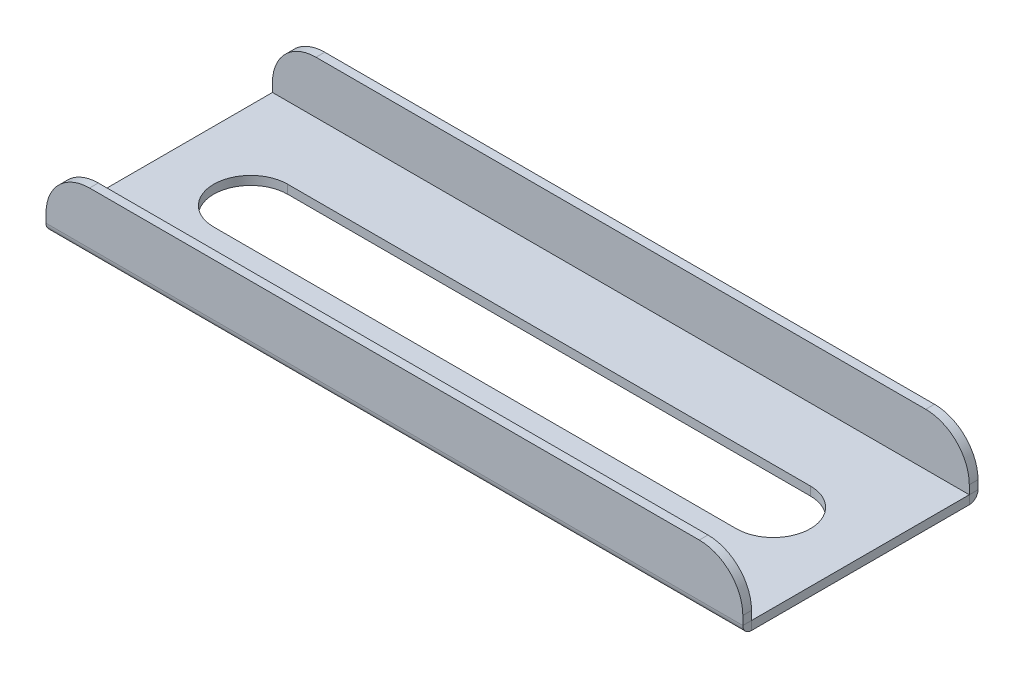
ISO-10303-21;
HEADER;
FILE_DESCRIPTION(('STEP AP214'),'2;1');
FILE_NAME('part.step','',(''),(''),'','','');
FILE_SCHEMA(('AUTOMOTIVE_DESIGN { 1 0 10303 214 1 1 1 1 }'));
ENDSEC;
DATA;
#1=APPLICATION_CONTEXT('core data for automotive mechanical design processes');
#2=APPLICATION_PROTOCOL_DEFINITION('international standard','automotive_design',2000,#1);
#3=PRODUCT_CONTEXT('',#1,'mechanical');
#4=PRODUCT('Part','Part','',(#3));
#5=PRODUCT_RELATED_PRODUCT_CATEGORY('part','',(#4));
#6=PRODUCT_DEFINITION_FORMATION('','',#4);
#7=PRODUCT_DEFINITION_CONTEXT('part definition',#1,'design');
#8=PRODUCT_DEFINITION('design','',#6,#7);
#9=PRODUCT_DEFINITION_SHAPE('','',#8);
#10=(LENGTH_UNIT() NAMED_UNIT(*) SI_UNIT(.MILLI.,.METRE.));
#11=(NAMED_UNIT(*) PLANE_ANGLE_UNIT() SI_UNIT($,.RADIAN.));
#12=(NAMED_UNIT(*) SI_UNIT($,.STERADIAN.) SOLID_ANGLE_UNIT());
#13=UNCERTAINTY_MEASURE_WITH_UNIT(LENGTH_MEASURE(1.E-05),#10,'distance_accuracy_value','');
#14=(GEOMETRIC_REPRESENTATION_CONTEXT(3) GLOBAL_UNCERTAINTY_ASSIGNED_CONTEXT((#13)) GLOBAL_UNIT_ASSIGNED_CONTEXT((#10,
#11,#12)) REPRESENTATION_CONTEXT('',''));
#15=CARTESIAN_POINT('',(0.,0.,0.));
#16=DIRECTION('',(0.,0.,1.));
#17=DIRECTION('',(1.,0.,0.));
#18=AXIS2_PLACEMENT_3D('',#15,#16,#17);
#19=CARTESIAN_POINT('',(80.,1.,-5.00000000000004));
#20=DIRECTION('',(-1.,0.,0.));
#21=DIRECTION('',(0.,0.,1.));
#22=AXIS2_PLACEMENT_3D('',#19,#20,#21);
#23=PLANE('',#22);
#24=DIRECTION('',(0.,0.,-1.));
#25=VECTOR('',#24,1.);
#26=CARTESIAN_POINT('',(80.,1.,-5.00000000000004));
#27=LINE('',#26,#25);
#28=CARTESIAN_POINT('',(80.,1.,-6.0001));
#29=VERTEX_POINT('',#28);
#30=CARTESIAN_POINT('',(80.,1.,-30.9999));
#31=VERTEX_POINT('',#30);
#32=EDGE_CURVE('E43',#29,#31,#27,.T.);
#33=ORIENTED_EDGE('',*,*,#32,.F.);
#34=DIRECTION('',(0.,-1.,0.));
#35=VECTOR('',#34,1.);
#36=CARTESIAN_POINT('',(80.,1.,-6.0001));
#37=LINE('',#36,#35);
#38=CARTESIAN_POINT('',(80.,0.,-6.0001));
#39=VERTEX_POINT('',#38);
#40=EDGE_CURVE('E12',#29,#39,#37,.T.);
#41=ORIENTED_EDGE('',*,*,#40,.T.);
#42=DIRECTION('',(0.,0.,-1.));
#43=VECTOR('',#42,1.);
#44=CARTESIAN_POINT('',(80.,0.,-5.00000000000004));
#45=LINE('',#44,#43);
#46=CARTESIAN_POINT('',(80.,0.,-30.9999));
#47=VERTEX_POINT('',#46);
#48=EDGE_CURVE('E342',#39,#47,#45,.T.);
#49=ORIENTED_EDGE('',*,*,#48,.T.);
#50=DIRECTION('',(0.,-1.,0.));
#51=VECTOR('',#50,1.);
#52=CARTESIAN_POINT('',(80.,0.999999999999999,-30.9999));
#53=LINE('',#52,#51);
#54=EDGE_CURVE('E327',#31,#47,#53,.T.);
#55=ORIENTED_EDGE('',*,*,#54,.F.);
#56=EDGE_LOOP('',(#33,#41,#49,#55));
#57=FACE_BOUND('',#56,.T.);
#58=ADVANCED_FACE('F40',(#57),#23,.F.);
#59=CARTESIAN_POINT('',(0.,1.,-5.00000000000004));
#60=DIRECTION('',(1.,0.,0.));
#61=DIRECTION('',(0.,0.,-1.));
#62=AXIS2_PLACEMENT_3D('',#59,#60,#61);
#63=PLANE('',#62);
#64=DIRECTION('',(0.,0.,1.));
#65=VECTOR('',#64,1.);
#66=CARTESIAN_POINT('',(0.,0.,-5.00000000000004));
#67=LINE('',#66,#65);
#68=CARTESIAN_POINT('',(0.,0.,-30.9999));
#69=VERTEX_POINT('',#68);
#70=CARTESIAN_POINT('',(0.,0.,-6.00010000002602));
#71=VERTEX_POINT('',#70);
#72=EDGE_CURVE('E64',#69,#71,#67,.T.);
#73=ORIENTED_EDGE('',*,*,#72,.T.);
#74=DIRECTION('',(0.,1.,0.));
#75=VECTOR('',#74,1.);
#76=CARTESIAN_POINT('',(0.,1.,-6.0001));
#77=LINE('',#76,#75);
#78=CARTESIAN_POINT('',(0.,1.,-6.0001));
#79=VERTEX_POINT('',#78);
#80=EDGE_CURVE('E338',#71,#79,#77,.T.);
#81=ORIENTED_EDGE('',*,*,#80,.T.);
#82=DIRECTION('',(0.,0.,1.));
#83=VECTOR('',#82,1.);
#84=CARTESIAN_POINT('',(0.,1.,-5.00000000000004));
#85=LINE('',#84,#83);
#86=CARTESIAN_POINT('',(0.,1.,-30.9999));
#87=VERTEX_POINT('',#86);
#88=EDGE_CURVE('E344',#87,#79,#85,.T.);
#89=ORIENTED_EDGE('',*,*,#88,.F.);
#90=DIRECTION('',(0.,1.,0.));
#91=VECTOR('',#90,1.);
#92=CARTESIAN_POINT('',(0.,0.999999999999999,-30.9999));
#93=LINE('',#92,#91);
#94=EDGE_CURVE('E333',#69,#87,#93,.T.);
#95=ORIENTED_EDGE('',*,*,#94,.F.);
#96=EDGE_LOOP('',(#73,#81,#89,#95));
#97=FACE_BOUND('',#96,.T.);
#98=ADVANCED_FACE('F368',(#97),#63,.F.);
#99=CARTESIAN_POINT('',(75.,0.,-32.));
#100=DIRECTION('',(0.,1.,0.));
#101=DIRECTION('',(0.,0.,1.));
#102=AXIS2_PLACEMENT_3D('',#99,#100,#101);
#103=PLANE('',#102);
#104=CARTESIAN_POINT('',(70.,0.,-18.5));
#105=DIRECTION('',(0.,1.,0.));
#106=DIRECTION('',(0.,0.,1.));
#107=AXIS2_PLACEMENT_3D('',#104,#105,#106);
#108=CIRCLE('',#107,4.25000000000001);
#109=CARTESIAN_POINT('',(70.,0.,-14.25));
#110=VERTEX_POINT('',#109);
#111=CARTESIAN_POINT('',(70.,0.,-22.75));
#112=VERTEX_POINT('',#111);
#113=EDGE_CURVE('E289',#110,#112,#108,.T.);
#114=ORIENTED_EDGE('',*,*,#113,.T.);
#115=DIRECTION('',(-1.,0.,0.));
#116=VECTOR('',#115,1.);
#117=CARTESIAN_POINT('',(70.,0.,-22.75));
#118=LINE('',#117,#116);
#119=CARTESIAN_POINT('',(10.,0.,-22.75));
#120=VERTEX_POINT('',#119);
#121=EDGE_CURVE('E307',#112,#120,#118,.T.);
#122=ORIENTED_EDGE('',*,*,#121,.T.);
#123=CARTESIAN_POINT('',(10.,0.,-18.5));
#124=DIRECTION('',(0.,1.,0.));
#125=DIRECTION('',(0.,0.,1.));
#126=AXIS2_PLACEMENT_3D('',#123,#124,#125);
#127=CIRCLE('',#126,4.25000000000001);
#128=CARTESIAN_POINT('',(10.,0.,-14.25));
#129=VERTEX_POINT('',#128);
#130=EDGE_CURVE('E310',#120,#129,#127,.T.);
#131=ORIENTED_EDGE('',*,*,#130,.T.);
#132=DIRECTION('',(1.,0.,0.));
#133=VECTOR('',#132,1.);
#134=CARTESIAN_POINT('',(10.,0.,-14.25));
#135=LINE('',#134,#133);
#136=EDGE_CURVE('E297',#129,#110,#135,.T.);
#137=ORIENTED_EDGE('',*,*,#136,.T.);
#138=EDGE_LOOP('',(#114,#122,#131,#137));
#139=FACE_BOUND('',#138,.T.);
#140=ORIENTED_EDGE('',*,*,#48,.F.);
#141=DIRECTION('',(-1.,0.,0.));
#142=VECTOR('',#141,1.);
#143=CARTESIAN_POINT('',(75.,0.,-6.0001));
#144=LINE('',#143,#142);
#145=EDGE_CURVE('E48',#39,#71,#144,.T.);
#146=ORIENTED_EDGE('',*,*,#145,.T.);
#147=ORIENTED_EDGE('',*,*,#72,.F.);
#148=DIRECTION('',(-1.,0.,0.));
#149=VECTOR('',#148,1.);
#150=CARTESIAN_POINT('',(75.,0.,-30.9999));
#151=LINE('',#150,#149);
#152=EDGE_CURVE('E330',#47,#69,#151,.T.);
#153=ORIENTED_EDGE('',*,*,#152,.F.);
#154=EDGE_LOOP('',(#140,#146,#147,#153));
#155=FACE_BOUND('',#154,.T.);
#156=ADVANCED_FACE('F418',(#139,#155),#103,.F.);
#157=CARTESIAN_POINT('',(75.,1.,-32.));
#158=DIRECTION('',(0.,1.,0.));
#159=DIRECTION('',(0.,0.,1.));
#160=AXIS2_PLACEMENT_3D('',#157,#158,#159);
#161=PLANE('',#160);
#162=DIRECTION('',(-1.,0.,0.));
#163=VECTOR('',#162,1.);
#164=CARTESIAN_POINT('',(75.,1.,-6.0001));
#165=LINE('',#164,#163);
#166=EDGE_CURVE('E336',#29,#79,#165,.T.);
#167=ORIENTED_EDGE('',*,*,#166,.F.);
#168=ORIENTED_EDGE('',*,*,#32,.T.);
#169=DIRECTION('',(-1.,0.,0.));
#170=VECTOR('',#169,1.);
#171=CARTESIAN_POINT('',(75.,1.,-30.9999));
#172=LINE('',#171,#170);
#173=EDGE_CURVE('E324',#31,#87,#172,.T.);
#174=ORIENTED_EDGE('',*,*,#173,.T.);
#175=ORIENTED_EDGE('',*,*,#88,.T.);
#176=EDGE_LOOP('',(#167,#168,#174,#175));
#177=FACE_BOUND('',#176,.T.);
#178=DIRECTION('',(-1.,0.,0.));
#179=VECTOR('',#178,1.);
#180=CARTESIAN_POINT('',(70.,1.,-22.75));
#181=LINE('',#180,#179);
#182=CARTESIAN_POINT('',(70.,1.,-22.75));
#183=VERTEX_POINT('',#182);
#184=CARTESIAN_POINT('',(10.,1.,-22.75));
#185=VERTEX_POINT('',#184);
#186=EDGE_CURVE('E296',#183,#185,#181,.T.);
#187=ORIENTED_EDGE('',*,*,#186,.F.);
#188=CARTESIAN_POINT('',(70.,1.,-18.5));
#189=DIRECTION('',(0.,1.,0.));
#190=DIRECTION('',(0.,0.,1.));
#191=AXIS2_PLACEMENT_3D('',#188,#189,#190);
#192=CIRCLE('',#191,4.25000000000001);
#193=CARTESIAN_POINT('',(70.,1.,-14.25));
#194=VERTEX_POINT('',#193);
#195=EDGE_CURVE('E294',#194,#183,#192,.T.);
#196=ORIENTED_EDGE('',*,*,#195,.F.);
#197=DIRECTION('',(1.,0.,0.));
#198=VECTOR('',#197,1.);
#199=CARTESIAN_POINT('',(10.,1.,-14.25));
#200=LINE('',#199,#198);
#201=CARTESIAN_POINT('',(9.99999999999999,1.,-14.25));
#202=VERTEX_POINT('',#201);
#203=EDGE_CURVE('E302',#202,#194,#200,.T.);
#204=ORIENTED_EDGE('',*,*,#203,.F.);
#205=CARTESIAN_POINT('',(10.,1.,-18.5));
#206=DIRECTION('',(0.,1.,0.));
#207=DIRECTION('',(0.,0.,1.));
#208=AXIS2_PLACEMENT_3D('',#205,#206,#207);
#209=CIRCLE('',#208,4.25000000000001);
#210=EDGE_CURVE('E299',#185,#202,#209,.T.);
#211=ORIENTED_EDGE('',*,*,#210,.F.);
#212=EDGE_LOOP('',(#187,#196,#204,#211));
#213=FACE_BOUND('',#212,.T.);
#214=ADVANCED_FACE('F350',(#177,#213),#161,.T.);
#215=CARTESIAN_POINT('',(70.,1.,-18.5));
#216=DIRECTION('',(0.,-1.,0.));
#217=DIRECTION('',(0.,0.,-1.));
#218=AXIS2_PLACEMENT_3D('',#215,#216,#217);
#219=CYLINDRICAL_SURFACE('',#218,4.25000000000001);
#220=ORIENTED_EDGE('',*,*,#113,.F.);
#221=DIRECTION('',(0.,-1.,0.));
#222=VECTOR('',#221,1.);
#223=CARTESIAN_POINT('',(70.,1.,-14.25));
#224=LINE('',#223,#222);
#225=EDGE_CURVE('E304',#194,#110,#224,.T.);
#226=ORIENTED_EDGE('',*,*,#225,.F.);
#227=ORIENTED_EDGE('',*,*,#195,.T.);
#228=DIRECTION('',(0.,-1.,0.));
#229=VECTOR('',#228,1.);
#230=CARTESIAN_POINT('',(70.,1.,-22.75));
#231=LINE('',#230,#229);
#232=EDGE_CURVE('E321',#183,#112,#231,.T.);
#233=ORIENTED_EDGE('',*,*,#232,.T.);
#234=EDGE_LOOP('',(#220,#226,#227,#233));
#235=FACE_BOUND('',#234,.T.);
#236=ADVANCED_FACE('F427',(#235),#219,.F.);
#237=CARTESIAN_POINT('',(70.,1.,-22.75));
#238=DIRECTION('',(0.,0.,1.));
#239=DIRECTION('',(1.,0.,0.));
#240=AXIS2_PLACEMENT_3D('',#237,#238,#239);
#241=PLANE('',#240);
#242=ORIENTED_EDGE('',*,*,#121,.F.);
#243=ORIENTED_EDGE('',*,*,#232,.F.);
#244=ORIENTED_EDGE('',*,*,#186,.T.);
#245=DIRECTION('',(0.,-1.,0.));
#246=VECTOR('',#245,1.);
#247=CARTESIAN_POINT('',(10.,1.,-22.75));
#248=LINE('',#247,#246);
#249=EDGE_CURVE('E319',#185,#120,#248,.T.);
#250=ORIENTED_EDGE('',*,*,#249,.T.);
#251=EDGE_LOOP('',(#242,#243,#244,#250));
#252=FACE_BOUND('',#251,.T.);
#253=ADVANCED_FACE('F430',(#252),#241,.T.);
#254=CARTESIAN_POINT('',(10.,1.,-18.5));
#255=DIRECTION('',(0.,-1.,0.));
#256=DIRECTION('',(0.,0.,-1.));
#257=AXIS2_PLACEMENT_3D('',#254,#255,#256);
#258=CYLINDRICAL_SURFACE('',#257,4.25000000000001);
#259=ORIENTED_EDGE('',*,*,#130,.F.);
#260=ORIENTED_EDGE('',*,*,#249,.F.);
#261=ORIENTED_EDGE('',*,*,#210,.T.);
#262=DIRECTION('',(0.,-1.,0.));
#263=VECTOR('',#262,1.);
#264=CARTESIAN_POINT('',(10.,1.,-14.25));
#265=LINE('',#264,#263);
#266=EDGE_CURVE('E317',#202,#129,#265,.T.);
#267=ORIENTED_EDGE('',*,*,#266,.T.);
#268=EDGE_LOOP('',(#259,#260,#261,#267));
#269=FACE_BOUND('',#268,.T.);
#270=ADVANCED_FACE('F434',(#269),#258,.F.);
#271=CARTESIAN_POINT('',(10.,1.,-14.25));
#272=DIRECTION('',(0.,0.,-1.));
#273=DIRECTION('',(-1.,0.,0.));
#274=AXIS2_PLACEMENT_3D('',#271,#272,#273);
#275=PLANE('',#274);
#276=ORIENTED_EDGE('',*,*,#136,.F.);
#277=ORIENTED_EDGE('',*,*,#266,.F.);
#278=ORIENTED_EDGE('',*,*,#203,.T.);
#279=ORIENTED_EDGE('',*,*,#225,.T.);
#280=EDGE_LOOP('',(#276,#277,#278,#279));
#281=FACE_BOUND('',#280,.T.);
#282=ADVANCED_FACE('F438',(#281),#275,.T.);
#283=CARTESIAN_POINT('',(80.,1.0001,-30.9999));
#284=DIRECTION('',(-1.,0.,0.));
#285=DIRECTION('',(0.,0.,1.));
#286=AXIS2_PLACEMENT_3D('',#283,#284,#285);
#287=PLANE('',#286);
#288=ORIENTED_EDGE('',*,*,#54,.T.);
#289=CARTESIAN_POINT('',(80.,1.0001,-30.9999));
#290=DIRECTION('',(-1.,0.,0.));
#291=DIRECTION('',(0.,0.,1.));
#292=AXIS2_PLACEMENT_3D('',#289,#290,#291);
#293=CIRCLE('',#292,1.0001);
#294=CARTESIAN_POINT('',(80.,1.0001,-32.));
#295=VERTEX_POINT('',#294);
#296=EDGE_CURVE('E239',#47,#295,#293,.F.);
#297=ORIENTED_EDGE('',*,*,#296,.T.);
#298=DIRECTION('',(0.,0.,-1.));
#299=VECTOR('',#298,1.);
#300=CARTESIAN_POINT('',(80.,1.0001,-31.));
#301=LINE('',#300,#299);
#302=CARTESIAN_POINT('',(80.,1.0001,-31.));
#303=VERTEX_POINT('',#302);
#304=EDGE_CURVE('E249',#303,#295,#301,.T.);
#305=ORIENTED_EDGE('',*,*,#304,.F.);
#306=CARTESIAN_POINT('',(80.,1.0001,-30.9999));
#307=DIRECTION('',(1.,0.,0.));
#308=DIRECTION('',(0.,0.,-1.));
#309=AXIS2_PLACEMENT_3D('',#306,#307,#308);
#310=CIRCLE('',#309,9.99999999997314E-05);
#311=EDGE_CURVE('E282',#31,#303,#310,.T.);
#312=ORIENTED_EDGE('',*,*,#311,.F.);
#313=EDGE_LOOP('',(#288,#297,#305,#312));
#314=FACE_BOUND('',#313,.T.);
#315=ADVANCED_FACE('F359',(#314),#287,.F.);
#316=CARTESIAN_POINT('',(0.,1.0001,-30.9999));
#317=DIRECTION('',(1.,0.,0.));
#318=DIRECTION('',(0.,0.,-1.));
#319=AXIS2_PLACEMENT_3D('',#316,#317,#318);
#320=PLANE('',#319);
#321=DIRECTION('',(0.,0.,1.));
#322=VECTOR('',#321,1.);
#323=CARTESIAN_POINT('',(0.,1.0001,-31.));
#324=LINE('',#323,#322);
#325=CARTESIAN_POINT('',(0.,1.0001,-32.));
#326=VERTEX_POINT('',#325);
#327=CARTESIAN_POINT('',(0.,1.0001,-31.));
#328=VERTEX_POINT('',#327);
#329=EDGE_CURVE('E240',#326,#328,#324,.T.);
#330=ORIENTED_EDGE('',*,*,#329,.F.);
#331=CARTESIAN_POINT('',(0.,1.0001,-30.9999));
#332=DIRECTION('',(-1.,0.,0.));
#333=DIRECTION('',(0.,0.,1.));
#334=AXIS2_PLACEMENT_3D('',#331,#332,#333);
#335=CIRCLE('',#334,1.0001);
#336=EDGE_CURVE('E286',#326,#69,#335,.T.);
#337=ORIENTED_EDGE('',*,*,#336,.T.);
#338=ORIENTED_EDGE('',*,*,#94,.T.);
#339=CARTESIAN_POINT('',(0.,1.0001,-30.9999));
#340=DIRECTION('',(-1.,0.,0.));
#341=DIRECTION('',(0.,0.,1.));
#342=AXIS2_PLACEMENT_3D('',#339,#340,#341);
#343=CIRCLE('',#342,9.99999999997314E-05);
#344=EDGE_CURVE('E285',#328,#87,#343,.T.);
#345=ORIENTED_EDGE('',*,*,#344,.F.);
#346=EDGE_LOOP('',(#330,#337,#338,#345));
#347=FACE_BOUND('',#346,.T.);
#348=ADVANCED_FACE('F365',(#347),#320,.F.);
#349=CARTESIAN_POINT('',(120.006249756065,1.0001,-30.9999));
#350=DIRECTION('',(-1.,0.,0.));
#351=DIRECTION('',(0.,0.,1.));
#352=AXIS2_PLACEMENT_3D('',#349,#350,#351);
#353=CYLINDRICAL_SURFACE('',#352,0.0001);
#354=ORIENTED_EDGE('',*,*,#344,.T.);
#355=ORIENTED_EDGE('',*,*,#173,.F.);
#356=ORIENTED_EDGE('',*,*,#311,.T.);
#357=DIRECTION('',(-1.,0.,0.));
#358=VECTOR('',#357,1.);
#359=CARTESIAN_POINT('',(75.,1.0001,-31.));
#360=LINE('',#359,#358);
#361=EDGE_CURVE('E231',#303,#328,#360,.T.);
#362=ORIENTED_EDGE('',*,*,#361,.T.);
#363=EDGE_LOOP('',(#354,#355,#356,#362));
#364=FACE_BOUND('',#363,.T.);
#365=ADVANCED_FACE('F361',(#364),#353,.F.);
#366=CARTESIAN_POINT('',(120.006249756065,1.0001,-30.9999));
#367=DIRECTION('',(-1.,0.,0.));
#368=DIRECTION('',(0.,0.,1.));
#369=AXIS2_PLACEMENT_3D('',#366,#367,#368);
#370=CYLINDRICAL_SURFACE('',#369,1.0001);
#371=ORIENTED_EDGE('',*,*,#336,.F.);
#372=DIRECTION('',(-1.,0.,0.));
#373=VECTOR('',#372,1.);
#374=CARTESIAN_POINT('',(75.,1.0001,-32.));
#375=LINE('',#374,#373);
#376=EDGE_CURVE('E244',#295,#326,#375,.T.);
#377=ORIENTED_EDGE('',*,*,#376,.F.);
#378=ORIENTED_EDGE('',*,*,#296,.F.);
#379=ORIENTED_EDGE('',*,*,#152,.T.);
#380=EDGE_LOOP('',(#371,#377,#378,#379));
#381=FACE_BOUND('',#380,.T.);
#382=ADVANCED_FACE('F447',(#381),#370,.T.);
#383=CARTESIAN_POINT('',(5.,2.00002721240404,-31.));
#384=DIRECTION('',(0.,0.,-1.));
#385=DIRECTION('',(0.,1.,0.));
#386=AXIS2_PLACEMENT_3D('',#383,#384,#385);
#387=CYLINDRICAL_SURFACE('',#386,5.);
#388=CARTESIAN_POINT('',(5.,2.00002721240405,-32.));
#389=DIRECTION('',(0.,0.,1.));
#390=DIRECTION('',(0.,1.,0.));
#391=AXIS2_PLACEMENT_3D('',#388,#389,#390);
#392=CIRCLE('',#391,5.);
#393=CARTESIAN_POINT('',(5.,7.00002721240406,-32.));
#394=VERTEX_POINT('',#393);
#395=CARTESIAN_POINT('',(0.,2.00002721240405,-32.));
#396=VERTEX_POINT('',#395);
#397=EDGE_CURVE('E278',#394,#396,#392,.T.);
#398=ORIENTED_EDGE('',*,*,#397,.T.);
#399=DIRECTION('',(0.,0.,-1.));
#400=VECTOR('',#399,1.);
#401=CARTESIAN_POINT('',(0.,2.00002721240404,-31.));
#402=LINE('',#401,#400);
#403=CARTESIAN_POINT('',(0.,2.00002721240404,-31.));
#404=VERTEX_POINT('',#403);
#405=EDGE_CURVE('E236',#404,#396,#402,.T.);
#406=ORIENTED_EDGE('',*,*,#405,.F.);
#407=CARTESIAN_POINT('',(5.,2.00002721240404,-31.));
#408=DIRECTION('',(0.,0.,1.));
#409=DIRECTION('',(0.,1.,0.));
#410=AXIS2_PLACEMENT_3D('',#407,#408,#409);
#411=CIRCLE('',#410,5.);
#412=CARTESIAN_POINT('',(5.,7.00002721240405,-31.));
#413=VERTEX_POINT('',#412);
#414=EDGE_CURVE('E255',#413,#404,#411,.T.);
#415=ORIENTED_EDGE('',*,*,#414,.F.);
#416=DIRECTION('',(0.,0.,-1.));
#417=VECTOR('',#416,1.);
#418=CARTESIAN_POINT('',(5.,7.00002721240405,-31.));
#419=LINE('',#418,#417);
#420=EDGE_CURVE('E275',#413,#394,#419,.T.);
#421=ORIENTED_EDGE('',*,*,#420,.T.);
#422=EDGE_LOOP('',(#398,#406,#415,#421));
#423=FACE_BOUND('',#422,.T.);
#424=ADVANCED_FACE('F450',(#423),#387,.T.);
#425=CARTESIAN_POINT('',(5.,7.00002721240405,-31.));
#426=DIRECTION('',(0.,-1.,0.));
#427=DIRECTION('',(1.,0.,0.));
#428=AXIS2_PLACEMENT_3D('',#425,#426,#427);
#429=PLANE('',#428);
#430=DIRECTION('',(-1.,0.,0.));
#431=VECTOR('',#430,1.);
#432=CARTESIAN_POINT('',(5.,7.00002721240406,-32.));
#433=LINE('',#432,#431);
#434=CARTESIAN_POINT('',(75.,7.00002721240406,-32.));
#435=VERTEX_POINT('',#434);
#436=EDGE_CURVE('E273',#435,#394,#433,.T.);
#437=ORIENTED_EDGE('',*,*,#436,.T.);
#438=ORIENTED_EDGE('',*,*,#420,.F.);
#439=DIRECTION('',(-1.,0.,0.));
#440=VECTOR('',#439,1.);
#441=CARTESIAN_POINT('',(5.,7.00002721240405,-31.));
#442=LINE('',#441,#440);
#443=CARTESIAN_POINT('',(75.,7.00002721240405,-31.));
#444=VERTEX_POINT('',#443);
#445=EDGE_CURVE('E257',#444,#413,#442,.T.);
#446=ORIENTED_EDGE('',*,*,#445,.F.);
#447=DIRECTION('',(0.,0.,-1.));
#448=VECTOR('',#447,1.);
#449=CARTESIAN_POINT('',(75.,7.00002721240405,-31.));
#450=LINE('',#449,#448);
#451=EDGE_CURVE('E270',#444,#435,#450,.T.);
#452=ORIENTED_EDGE('',*,*,#451,.T.);
#453=EDGE_LOOP('',(#437,#438,#446,#452));
#454=FACE_BOUND('',#453,.T.);
#455=ADVANCED_FACE('F473',(#454),#429,.F.);
#456=CARTESIAN_POINT('',(75.,2.00002721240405,-31.));
#457=DIRECTION('',(0.,0.,-1.));
#458=DIRECTION('',(0.,1.,0.));
#459=AXIS2_PLACEMENT_3D('',#456,#457,#458);
#460=CYLINDRICAL_SURFACE('',#459,5.);
#461=CARTESIAN_POINT('',(75.,2.00002721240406,-32.));
#462=DIRECTION('',(0.,0.,1.));
#463=DIRECTION('',(0.,-1.,0.));
#464=AXIS2_PLACEMENT_3D('',#461,#462,#463);
#465=CIRCLE('',#464,5.);
#466=CARTESIAN_POINT('',(80.,2.00002721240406,-32.));
#467=VERTEX_POINT('',#466);
#468=EDGE_CURVE('E267',#467,#435,#465,.T.);
#469=ORIENTED_EDGE('',*,*,#468,.T.);
#470=ORIENTED_EDGE('',*,*,#451,.F.);
#471=CARTESIAN_POINT('',(75.,2.00002721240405,-31.));
#472=DIRECTION('',(0.,0.,1.));
#473=DIRECTION('',(0.,-1.,0.));
#474=AXIS2_PLACEMENT_3D('',#471,#472,#473);
#475=CIRCLE('',#474,5.);
#476=CARTESIAN_POINT('',(80.,2.00002721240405,-31.));
#477=VERTEX_POINT('',#476);
#478=EDGE_CURVE('E259',#477,#444,#475,.T.);
#479=ORIENTED_EDGE('',*,*,#478,.F.);
#480=DIRECTION('',(0.,0.,-1.));
#481=VECTOR('',#480,1.);
#482=CARTESIAN_POINT('',(80.,2.00002721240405,-31.));
#483=LINE('',#482,#481);
#484=EDGE_CURVE('E264',#477,#467,#483,.T.);
#485=ORIENTED_EDGE('',*,*,#484,.T.);
#486=EDGE_LOOP('',(#469,#470,#479,#485));
#487=FACE_BOUND('',#486,.T.);
#488=ADVANCED_FACE('F469',(#487),#460,.T.);
#489=CARTESIAN_POINT('',(75.,2.00002721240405,-31.));
#490=DIRECTION('',(0.,0.,1.));
#491=DIRECTION('',(0.,-1.,0.));
#492=AXIS2_PLACEMENT_3D('',#489,#490,#491);
#493=PLANE('',#492);
#494=ORIENTED_EDGE('',*,*,#361,.F.);
#495=DIRECTION('',(0.,1.,0.));
#496=VECTOR('',#495,1.);
#497=CARTESIAN_POINT('',(80.,-24.9999727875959,-31.0000000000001));
#498=LINE('',#497,#496);
#499=EDGE_CURVE('E262',#303,#477,#498,.T.);
#500=ORIENTED_EDGE('',*,*,#499,.T.);
#501=ORIENTED_EDGE('',*,*,#478,.T.);
#502=ORIENTED_EDGE('',*,*,#445,.T.);
#503=ORIENTED_EDGE('',*,*,#414,.T.);
#504=DIRECTION('',(0.,-1.,0.));
#505=VECTOR('',#504,1.);
#506=CARTESIAN_POINT('',(0.,-24.9999727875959,-31.0000000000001));
#507=LINE('',#506,#505);
#508=EDGE_CURVE('E252',#404,#328,#507,.T.);
#509=ORIENTED_EDGE('',*,*,#508,.T.);
#510=EDGE_LOOP('',(#494,#500,#501,#502,#503,#509));
#511=FACE_BOUND('',#510,.T.);
#512=ADVANCED_FACE('F465',(#511),#493,.T.);
#513=CARTESIAN_POINT('',(80.,-24.9999727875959,-31.0000000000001));
#514=DIRECTION('',(-1.,0.,0.));
#515=DIRECTION('',(0.,-1.,0.));
#516=AXIS2_PLACEMENT_3D('',#513,#514,#515);
#517=PLANE('',#516);
#518=ORIENTED_EDGE('',*,*,#499,.F.);
#519=ORIENTED_EDGE('',*,*,#304,.T.);
#520=DIRECTION('',(0.,1.,0.));
#521=VECTOR('',#520,1.);
#522=CARTESIAN_POINT('',(80.,-24.9999727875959,-32.0000000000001));
#523=LINE('',#522,#521);
#524=EDGE_CURVE('E247',#295,#467,#523,.T.);
#525=ORIENTED_EDGE('',*,*,#524,.T.);
#526=ORIENTED_EDGE('',*,*,#484,.F.);
#527=EDGE_LOOP('',(#518,#519,#525,#526));
#528=FACE_BOUND('',#527,.T.);
#529=ADVANCED_FACE('F461',(#528),#517,.F.);
#530=CARTESIAN_POINT('',(75.,2.00002721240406,-32.));
#531=DIRECTION('',(0.,0.,1.));
#532=DIRECTION('',(0.,-1.,0.));
#533=AXIS2_PLACEMENT_3D('',#530,#531,#532);
#534=PLANE('',#533);
#535=ORIENTED_EDGE('',*,*,#524,.F.);
#536=ORIENTED_EDGE('',*,*,#376,.T.);
#537=DIRECTION('',(0.,-1.,0.));
#538=VECTOR('',#537,1.);
#539=CARTESIAN_POINT('',(0.,-24.9999727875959,-32.0000000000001));
#540=LINE('',#539,#538);
#541=EDGE_CURVE('E242',#396,#326,#540,.T.);
#542=ORIENTED_EDGE('',*,*,#541,.F.);
#543=ORIENTED_EDGE('',*,*,#397,.F.);
#544=ORIENTED_EDGE('',*,*,#436,.F.);
#545=ORIENTED_EDGE('',*,*,#468,.F.);
#546=EDGE_LOOP('',(#535,#536,#542,#543,#544,#545));
#547=FACE_BOUND('',#546,.T.);
#548=ADVANCED_FACE('F457',(#547),#534,.F.);
#549=CARTESIAN_POINT('',(0.,-24.9999727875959,-31.0000000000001));
#550=DIRECTION('',(1.,0.,0.));
#551=DIRECTION('',(0.,1.,0.));
#552=AXIS2_PLACEMENT_3D('',#549,#550,#551);
#553=PLANE('',#552);
#554=ORIENTED_EDGE('',*,*,#541,.T.);
#555=ORIENTED_EDGE('',*,*,#329,.T.);
#556=ORIENTED_EDGE('',*,*,#508,.F.);
#557=ORIENTED_EDGE('',*,*,#405,.T.);
#558=EDGE_LOOP('',(#554,#555,#556,#557));
#559=FACE_BOUND('',#558,.T.);
#560=ADVANCED_FACE('F454',(#559),#553,.F.);
#561=CARTESIAN_POINT('',(80.,1.0001,-6.0001));
#562=DIRECTION('',(-1.,0.,0.));
#563=DIRECTION('',(0.,0.,1.));
#564=AXIS2_PLACEMENT_3D('',#561,#562,#563);
#565=PLANE('',#564);
#566=DIRECTION('',(0.,0.,1.));
#567=VECTOR('',#566,1.);
#568=CARTESIAN_POINT('',(80.,1.0001,-6.));
#569=LINE('',#568,#567);
#570=CARTESIAN_POINT('',(80.,1.0001,-6.));
#571=VERTEX_POINT('',#570);
#572=CARTESIAN_POINT('',(80.,1.0001,-5.));
#573=VERTEX_POINT('',#572);
#574=EDGE_CURVE('E222',#571,#573,#569,.T.);
#575=ORIENTED_EDGE('',*,*,#574,.T.);
#576=CARTESIAN_POINT('',(80.,1.0001,-6.0001));
#577=DIRECTION('',(1.,0.,0.));
#578=DIRECTION('',(0.,0.,-1.));
#579=AXIS2_PLACEMENT_3D('',#576,#577,#578);
#580=CIRCLE('',#579,1.0001);
#581=EDGE_CURVE('E56',#573,#39,#580,.T.);
#582=ORIENTED_EDGE('',*,*,#581,.T.);
#583=ORIENTED_EDGE('',*,*,#40,.F.);
#584=CARTESIAN_POINT('',(80.,1.0001,-6.0001));
#585=DIRECTION('',(1.,0.,0.));
#586=DIRECTION('',(0.,0.,-1.));
#587=AXIS2_PLACEMENT_3D('',#584,#585,#586);
#588=CIRCLE('',#587,0.000100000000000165);
#589=EDGE_CURVE('E224',#571,#29,#588,.T.);
#590=ORIENTED_EDGE('',*,*,#589,.F.);
#591=EDGE_LOOP('',(#575,#582,#583,#590));
#592=FACE_BOUND('',#591,.T.);
#593=ADVANCED_FACE('F377',(#592),#565,.F.);
#594=CARTESIAN_POINT('',(0.,1.0001,-6.0001));
#595=DIRECTION('',(1.,0.,0.));
#596=DIRECTION('',(0.,0.,-1.));
#597=AXIS2_PLACEMENT_3D('',#594,#595,#596);
#598=PLANE('',#597);
#599=CARTESIAN_POINT('',(0.,1.0001,-6.0001));
#600=DIRECTION('',(1.,0.,0.));
#601=DIRECTION('',(0.,0.,-1.));
#602=AXIS2_PLACEMENT_3D('',#599,#600,#601);
#603=CIRCLE('',#602,1.0001);
#604=CARTESIAN_POINT('',(0.,1.0001,-5.));
#605=VERTEX_POINT('',#604);
#606=EDGE_CURVE('E228',#71,#605,#603,.F.);
#607=ORIENTED_EDGE('',*,*,#606,.T.);
#608=DIRECTION('',(0.,0.,-1.));
#609=VECTOR('',#608,1.);
#610=CARTESIAN_POINT('',(0.,1.0001,-6.));
#611=LINE('',#610,#609);
#612=CARTESIAN_POINT('',(0.,1.0001,-6.));
#613=VERTEX_POINT('',#612);
#614=EDGE_CURVE('E188',#605,#613,#611,.T.);
#615=ORIENTED_EDGE('',*,*,#614,.T.);
#616=CARTESIAN_POINT('',(0.,1.0001,-6.0001));
#617=DIRECTION('',(-1.,0.,0.));
#618=DIRECTION('',(0.,0.,1.));
#619=AXIS2_PLACEMENT_3D('',#616,#617,#618);
#620=CIRCLE('',#619,0.000100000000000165);
#621=EDGE_CURVE('E227',#79,#613,#620,.T.);
#622=ORIENTED_EDGE('',*,*,#621,.F.);
#623=ORIENTED_EDGE('',*,*,#80,.F.);
#624=EDGE_LOOP('',(#607,#615,#622,#623));
#625=FACE_BOUND('',#624,.T.);
#626=ADVANCED_FACE('F372',(#625),#598,.F.);
#627=CARTESIAN_POINT('',(-40.006249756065,1.0001,-6.0001));
#628=DIRECTION('',(1.,0.,0.));
#629=DIRECTION('',(0.,0.,-1.));
#630=AXIS2_PLACEMENT_3D('',#627,#628,#629);
#631=CYLINDRICAL_SURFACE('',#630,0.0001);
#632=ORIENTED_EDGE('',*,*,#166,.T.);
#633=ORIENTED_EDGE('',*,*,#621,.T.);
#634=DIRECTION('',(-1.,0.,0.));
#635=VECTOR('',#634,1.);
#636=CARTESIAN_POINT('',(75.,1.0001,-6.));
#637=LINE('',#636,#635);
#638=EDGE_CURVE('E386',#571,#613,#637,.T.);
#639=ORIENTED_EDGE('',*,*,#638,.F.);
#640=ORIENTED_EDGE('',*,*,#589,.T.);
#641=EDGE_LOOP('',(#632,#633,#639,#640));
#642=FACE_BOUND('',#641,.T.);
#643=ADVANCED_FACE('F390',(#642),#631,.F.);
#644=CARTESIAN_POINT('',(-40.006249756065,1.0001,-6.0001));
#645=DIRECTION('',(1.,0.,0.));
#646=DIRECTION('',(0.,0.,-1.));
#647=AXIS2_PLACEMENT_3D('',#644,#645,#646);
#648=CYLINDRICAL_SURFACE('',#647,1.0001);
#649=ORIENTED_EDGE('',*,*,#145,.F.);
#650=ORIENTED_EDGE('',*,*,#581,.F.);
#651=DIRECTION('',(-1.,0.,0.));
#652=VECTOR('',#651,1.);
#653=CARTESIAN_POINT('',(75.,1.00010000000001,-5.));
#654=LINE('',#653,#652);
#655=EDGE_CURVE('E220',#573,#605,#654,.T.);
#656=ORIENTED_EDGE('',*,*,#655,.T.);
#657=ORIENTED_EDGE('',*,*,#606,.F.);
#658=EDGE_LOOP('',(#649,#650,#656,#657));
#659=FACE_BOUND('',#658,.T.);
#660=ADVANCED_FACE('F374',(#659),#648,.T.);
#661=CARTESIAN_POINT('',(75.,2.00002721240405,-6.));
#662=DIRECTION('',(0.,0.,1.));
#663=DIRECTION('',(0.,-1.,0.));
#664=AXIS2_PLACEMENT_3D('',#661,#662,#663);
#665=CYLINDRICAL_SURFACE('',#664,5.);
#666=CARTESIAN_POINT('',(75.,2.00002721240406,-5.));
#667=DIRECTION('',(0.,0.,-1.));
#668=DIRECTION('',(0.,1.,0.));
#669=AXIS2_PLACEMENT_3D('',#666,#667,#668);
#670=CIRCLE('',#669,5.);
#671=CARTESIAN_POINT('',(75.,7.00002721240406,-5.00000000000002));
#672=VERTEX_POINT('',#671);
#673=CARTESIAN_POINT('',(80.,2.00002721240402,-5.));
#674=VERTEX_POINT('',#673);
#675=EDGE_CURVE('E217',#672,#674,#670,.T.);
#676=ORIENTED_EDGE('',*,*,#675,.T.);
#677=DIRECTION('',(0.,0.,1.));
#678=VECTOR('',#677,1.);
#679=CARTESIAN_POINT('',(80.,2.00002721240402,-6.));
#680=LINE('',#679,#678);
#681=CARTESIAN_POINT('',(80.,2.00002721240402,-6.));
#682=VERTEX_POINT('',#681);
#683=EDGE_CURVE('E193',#682,#674,#680,.T.);
#684=ORIENTED_EDGE('',*,*,#683,.F.);
#685=CARTESIAN_POINT('',(75.,2.00002721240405,-6.));
#686=DIRECTION('',(0.,0.,-1.));
#687=DIRECTION('',(0.,1.,0.));
#688=AXIS2_PLACEMENT_3D('',#685,#686,#687);
#689=CIRCLE('',#688,5.);
#690=CARTESIAN_POINT('',(75.,7.00002721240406,-6.00000000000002));
#691=VERTEX_POINT('',#690);
#692=EDGE_CURVE('E194',#691,#682,#689,.T.);
#693=ORIENTED_EDGE('',*,*,#692,.F.);
#694=DIRECTION('',(0.,0.,1.));
#695=VECTOR('',#694,1.);
#696=CARTESIAN_POINT('',(75.,7.00002721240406,-6.00000000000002));
#697=LINE('',#696,#695);
#698=EDGE_CURVE('E214',#691,#672,#697,.T.);
#699=ORIENTED_EDGE('',*,*,#698,.T.);
#700=EDGE_LOOP('',(#676,#684,#693,#699));
#701=FACE_BOUND('',#700,.T.);
#702=ADVANCED_FACE('F401',(#701),#665,.T.);
#703=CARTESIAN_POINT('',(5.00000000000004,7.00002721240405,-6.00000000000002));
#704=DIRECTION('',(0.,-1.,0.));
#705=DIRECTION('',(-1.,0.,0.));
#706=AXIS2_PLACEMENT_3D('',#703,#704,#705);
#707=PLANE('',#706);
#708=DIRECTION('',(1.,0.,0.));
#709=VECTOR('',#708,1.);
#710=CARTESIAN_POINT('',(5.00000000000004,7.00002721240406,-5.00000000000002));
#711=LINE('',#710,#709);
#712=CARTESIAN_POINT('',(5.00000000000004,7.00002721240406,-5.00000000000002));
#713=VERTEX_POINT('',#712);
#714=EDGE_CURVE('E207',#713,#672,#711,.T.);
#715=ORIENTED_EDGE('',*,*,#714,.T.);
#716=ORIENTED_EDGE('',*,*,#698,.F.);
#717=DIRECTION('',(1.,0.,0.));
#718=VECTOR('',#717,1.);
#719=CARTESIAN_POINT('',(5.00000000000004,7.00002721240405,-6.00000000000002));
#720=LINE('',#719,#718);
#721=CARTESIAN_POINT('',(5.00000000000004,7.00002721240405,-6.00000000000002));
#722=VERTEX_POINT('',#721);
#723=EDGE_CURVE('E396',#722,#691,#720,.T.);
#724=ORIENTED_EDGE('',*,*,#723,.F.);
#725=DIRECTION('',(0.,0.,1.));
#726=VECTOR('',#725,1.);
#727=CARTESIAN_POINT('',(5.00000000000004,7.00002721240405,-6.00000000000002));
#728=LINE('',#727,#726);
#729=EDGE_CURVE('E208',#722,#713,#728,.T.);
#730=ORIENTED_EDGE('',*,*,#729,.T.);
#731=EDGE_LOOP('',(#715,#716,#724,#730));
#732=FACE_BOUND('',#731,.T.);
#733=ADVANCED_FACE('F405',(#732),#707,.F.);
#734=CARTESIAN_POINT('',(5.,2.00002721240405,-6.));
#735=DIRECTION('',(0.,0.,1.));
#736=DIRECTION('',(0.,-1.,0.));
#737=AXIS2_PLACEMENT_3D('',#734,#735,#736);
#738=CYLINDRICAL_SURFACE('',#737,5.);
#739=CARTESIAN_POINT('',(5.,2.00002721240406,-5.));
#740=DIRECTION('',(0.,0.,-1.));
#741=DIRECTION('',(0.,1.,0.));
#742=AXIS2_PLACEMENT_3D('',#739,#740,#741);
#743=CIRCLE('',#742,5.);
#744=CARTESIAN_POINT('',(0.,2.00002721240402,-5.));
#745=VERTEX_POINT('',#744);
#746=EDGE_CURVE('E199',#745,#713,#743,.T.);
#747=ORIENTED_EDGE('',*,*,#746,.T.);
#748=ORIENTED_EDGE('',*,*,#729,.F.);
#749=CARTESIAN_POINT('',(5.,2.00002721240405,-6.));
#750=DIRECTION('',(0.,0.,-1.));
#751=DIRECTION('',(0.,1.,0.));
#752=AXIS2_PLACEMENT_3D('',#749,#750,#751);
#753=CIRCLE('',#752,5.);
#754=CARTESIAN_POINT('',(0.,2.00002721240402,-6.));
#755=VERTEX_POINT('',#754);
#756=EDGE_CURVE('E201',#755,#722,#753,.T.);
#757=ORIENTED_EDGE('',*,*,#756,.F.);
#758=DIRECTION('',(0.,0.,1.));
#759=VECTOR('',#758,1.);
#760=CARTESIAN_POINT('',(0.,2.00002721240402,-6.));
#761=LINE('',#760,#759);
#762=EDGE_CURVE('E185',#755,#745,#761,.T.);
#763=ORIENTED_EDGE('',*,*,#762,.T.);
#764=EDGE_LOOP('',(#747,#748,#757,#763));
#765=FACE_BOUND('',#764,.T.);
#766=ADVANCED_FACE('F197',(#765),#738,.T.);
#767=CARTESIAN_POINT('',(75.,-24.999972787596,-5.99999999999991));
#768=DIRECTION('',(0.,0.,-1.));
#769=DIRECTION('',(0.,1.,0.));
#770=AXIS2_PLACEMENT_3D('',#767,#768,#769);
#771=PLANE('',#770);
#772=DIRECTION('',(0.,-1.,0.));
#773=VECTOR('',#772,1.);
#774=CARTESIAN_POINT('',(80.,2.00002721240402,-6.));
#775=LINE('',#774,#773);
#776=EDGE_CURVE('E202',#682,#571,#775,.T.);
#777=ORIENTED_EDGE('',*,*,#776,.T.);
#778=ORIENTED_EDGE('',*,*,#638,.T.);
#779=DIRECTION('',(0.,1.,0.));
#780=VECTOR('',#779,1.);
#781=CARTESIAN_POINT('',(0.,2.00002721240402,-6.));
#782=LINE('',#781,#780);
#783=EDGE_CURVE('E391',#613,#755,#782,.T.);
#784=ORIENTED_EDGE('',*,*,#783,.T.);
#785=ORIENTED_EDGE('',*,*,#756,.T.);
#786=ORIENTED_EDGE('',*,*,#723,.T.);
#787=ORIENTED_EDGE('',*,*,#692,.T.);
#788=EDGE_LOOP('',(#777,#778,#784,#785,#786,#787));
#789=FACE_BOUND('',#788,.T.);
#790=ADVANCED_FACE('F385',(#789),#771,.T.);
#791=CARTESIAN_POINT('',(0.,2.00002721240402,-6.));
#792=DIRECTION('',(1.,0.,0.));
#793=DIRECTION('',(0.,-1.,0.));
#794=AXIS2_PLACEMENT_3D('',#791,#792,#793);
#795=PLANE('',#794);
#796=ORIENTED_EDGE('',*,*,#614,.F.);
#797=DIRECTION('',(0.,1.,0.));
#798=VECTOR('',#797,1.);
#799=CARTESIAN_POINT('',(0.,2.00002721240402,-5.));
#800=LINE('',#799,#798);
#801=EDGE_CURVE('E181',#605,#745,#800,.T.);
#802=ORIENTED_EDGE('',*,*,#801,.T.);
#803=ORIENTED_EDGE('',*,*,#762,.F.);
#804=ORIENTED_EDGE('',*,*,#783,.F.);
#805=EDGE_LOOP('',(#796,#802,#803,#804));
#806=FACE_BOUND('',#805,.T.);
#807=ADVANCED_FACE('F183',(#806),#795,.F.);
#808=CARTESIAN_POINT('',(75.,-24.9999727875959,-4.99999999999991));
#809=DIRECTION('',(0.,0.,-1.));
#810=DIRECTION('',(0.,1.,0.));
#811=AXIS2_PLACEMENT_3D('',#808,#809,#810);
#812=PLANE('',#811);
#813=ORIENTED_EDGE('',*,*,#655,.F.);
#814=DIRECTION('',(0.,-1.,0.));
#815=VECTOR('',#814,1.);
#816=CARTESIAN_POINT('',(80.,2.00002721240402,-5.));
#817=LINE('',#816,#815);
#818=EDGE_CURVE('E233',#674,#573,#817,.T.);
#819=ORIENTED_EDGE('',*,*,#818,.F.);
#820=ORIENTED_EDGE('',*,*,#675,.F.);
#821=ORIENTED_EDGE('',*,*,#714,.F.);
#822=ORIENTED_EDGE('',*,*,#746,.F.);
#823=ORIENTED_EDGE('',*,*,#801,.F.);
#824=EDGE_LOOP('',(#813,#819,#820,#821,#822,#823));
#825=FACE_BOUND('',#824,.T.);
#826=ADVANCED_FACE('F205',(#825),#812,.F.);
#827=CARTESIAN_POINT('',(80.,2.00002721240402,-6.));
#828=DIRECTION('',(-1.,0.,0.));
#829=DIRECTION('',(0.,1.,0.));
#830=AXIS2_PLACEMENT_3D('',#827,#828,#829);
#831=PLANE('',#830);
#832=ORIENTED_EDGE('',*,*,#574,.F.);
#833=ORIENTED_EDGE('',*,*,#776,.F.);
#834=ORIENTED_EDGE('',*,*,#683,.T.);
#835=ORIENTED_EDGE('',*,*,#818,.T.);
#836=EDGE_LOOP('',(#832,#833,#834,#835));
#837=FACE_BOUND('',#836,.T.);
#838=ADVANCED_FACE('F381',(#837),#831,.F.);
#839=CLOSED_SHELL('',(#58,#98,#156,#214,#236,#253,#270,#282,#315,#348,#365,#382,#424,#455,#488,
#512,#529,#548,#560,#593,#626,#643,#660,#702,#733,#766,#790,#807,#826,#838));
#840=MANIFOLD_SOLID_BREP('B2',#839);
#841=ADVANCED_BREP_SHAPE_REPRESENTATION('',(#18,#840),#14);
#842=SHAPE_DEFINITION_REPRESENTATION(#9,#841);
ENDSEC;
END-ISO-10303-21;
